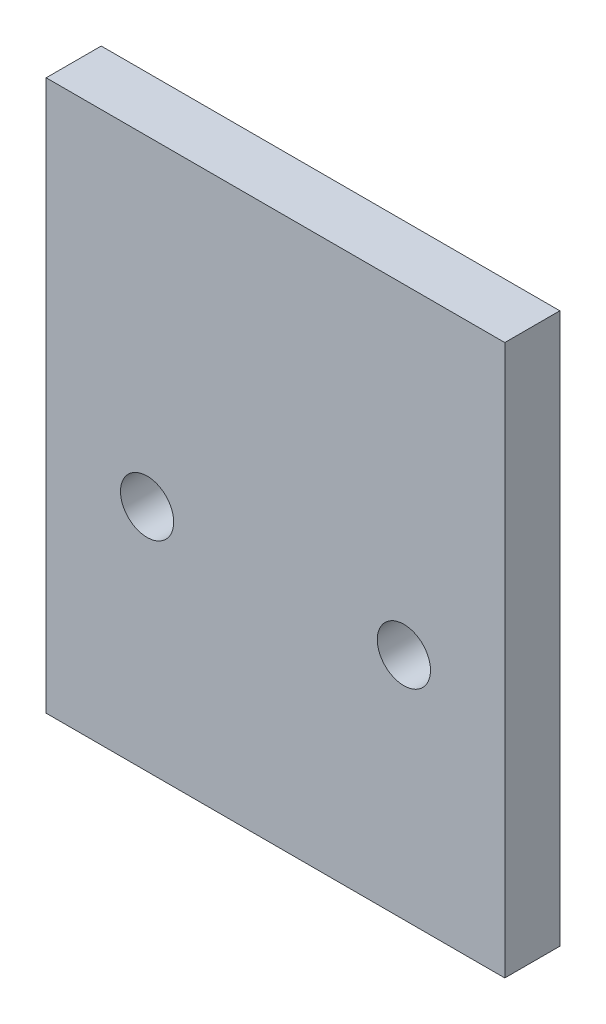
ISO-10303-21;
HEADER;
FILE_DESCRIPTION(('STEP AP214'),'2;1');
FILE_NAME('part.step','',(''),(''),'','','');
FILE_SCHEMA(('AUTOMOTIVE_DESIGN { 1 0 10303 214 1 1 1 1 }'));
ENDSEC;
DATA;
#1=APPLICATION_CONTEXT('core data for automotive mechanical design processes');
#2=APPLICATION_PROTOCOL_DEFINITION('international standard','automotive_design',2000,#1);
#3=PRODUCT_CONTEXT('',#1,'mechanical');
#4=PRODUCT('Part','Part','',(#3));
#5=PRODUCT_RELATED_PRODUCT_CATEGORY('part','',(#4));
#6=PRODUCT_DEFINITION_FORMATION('','',#4);
#7=PRODUCT_DEFINITION_CONTEXT('part definition',#1,'design');
#8=PRODUCT_DEFINITION('design','',#6,#7);
#9=PRODUCT_DEFINITION_SHAPE('','',#8);
#10=(LENGTH_UNIT() NAMED_UNIT(*) SI_UNIT(.MILLI.,.METRE.));
#11=(NAMED_UNIT(*) PLANE_ANGLE_UNIT() SI_UNIT($,.RADIAN.));
#12=(NAMED_UNIT(*) SI_UNIT($,.STERADIAN.) SOLID_ANGLE_UNIT());
#13=UNCERTAINTY_MEASURE_WITH_UNIT(LENGTH_MEASURE(1.E-05),#10,'distance_accuracy_value','');
#14=(GEOMETRIC_REPRESENTATION_CONTEXT(3) GLOBAL_UNCERTAINTY_ASSIGNED_CONTEXT((#13)) GLOBAL_UNIT_ASSIGNED_CONTEXT((#10,
#11,#12)) REPRESENTATION_CONTEXT('',''));
#15=CARTESIAN_POINT('',(0.,0.,0.));
#16=DIRECTION('',(0.,0.,1.));
#17=DIRECTION('',(1.,0.,0.));
#18=AXIS2_PLACEMENT_3D('',#15,#16,#17);
#19=CARTESIAN_POINT('',(0.,0.,3.));
#20=DIRECTION('',(0.,0.,-1.));
#21=DIRECTION('',(-1.,0.,0.));
#22=AXIS2_PLACEMENT_3D('',#19,#20,#21);
#23=PLANE('',#22);
#24=DIRECTION('',(0.,-1.,0.));
#25=VECTOR('',#24,1.);
#26=CARTESIAN_POINT('',(0.,0.,3.));
#27=LINE('',#26,#25);
#28=CARTESIAN_POINT('',(0.,30.,3.));
#29=VERTEX_POINT('',#28);
#30=CARTESIAN_POINT('',(0.,0.,3.));
#31=VERTEX_POINT('',#30);
#32=EDGE_CURVE('E87',#29,#31,#27,.T.);
#33=ORIENTED_EDGE('',*,*,#32,.T.);
#34=DIRECTION('',(1.,0.,0.));
#35=VECTOR('',#34,1.);
#36=CARTESIAN_POINT('',(0.,0.,3.));
#37=LINE('',#36,#35);
#38=CARTESIAN_POINT('',(25.,0.,3.));
#39=VERTEX_POINT('',#38);
#40=EDGE_CURVE('E82',#31,#39,#37,.T.);
#41=ORIENTED_EDGE('',*,*,#40,.T.);
#42=DIRECTION('',(0.,1.,0.));
#43=VECTOR('',#42,1.);
#44=CARTESIAN_POINT('',(25.,0.,3.));
#45=LINE('',#44,#43);
#46=CARTESIAN_POINT('',(25.,30.,3.));
#47=VERTEX_POINT('',#46);
#48=EDGE_CURVE('E85',#39,#47,#45,.T.);
#49=ORIENTED_EDGE('',*,*,#48,.T.);
#50=DIRECTION('',(-1.,0.,0.));
#51=VECTOR('',#50,1.);
#52=CARTESIAN_POINT('',(0.,30.,3.));
#53=LINE('',#52,#51);
#54=EDGE_CURVE('E52',#47,#29,#53,.T.);
#55=ORIENTED_EDGE('',*,*,#54,.T.);
#56=EDGE_LOOP('',(#33,#41,#49,#55));
#57=FACE_BOUND('',#56,.T.);
#58=CARTESIAN_POINT('',(19.5,12.5,3.));
#59=DIRECTION('',(0.,0.,1.));
#60=DIRECTION('',(1.,0.,0.));
#61=AXIS2_PLACEMENT_3D('',#58,#59,#60);
#62=CIRCLE('',#61,1.45);
#63=CARTESIAN_POINT('',(20.95,12.5,3.));
#64=VERTEX_POINT('',#63);
#65=EDGE_CURVE('E102',#64,#64,#62,.T.);
#66=ORIENTED_EDGE('',*,*,#65,.F.);
#67=EDGE_LOOP('',(#66));
#68=FACE_BOUND('',#67,.T.);
#69=CARTESIAN_POINT('',(5.5,12.5,3.));
#70=DIRECTION('',(0.,0.,1.));
#71=DIRECTION('',(-1.,0.,0.));
#72=AXIS2_PLACEMENT_3D('',#69,#70,#71);
#73=CIRCLE('',#72,1.45);
#74=CARTESIAN_POINT('',(4.05,12.5,3.));
#75=VERTEX_POINT('',#74);
#76=EDGE_CURVE('E117',#75,#75,#73,.T.);
#77=ORIENTED_EDGE('',*,*,#76,.F.);
#78=EDGE_LOOP('',(#77));
#79=FACE_BOUND('',#78,.T.);
#80=ADVANCED_FACE('F35',(#57,#68,#79),#23,.F.);
#81=CARTESIAN_POINT('',(0.,0.,0.));
#82=DIRECTION('',(0.,0.,-1.));
#83=DIRECTION('',(-1.,0.,0.));
#84=AXIS2_PLACEMENT_3D('',#81,#82,#83);
#85=PLANE('',#84);
#86=CARTESIAN_POINT('',(19.5,12.5,0.));
#87=DIRECTION('',(0.,0.,1.));
#88=DIRECTION('',(1.,0.,0.));
#89=AXIS2_PLACEMENT_3D('',#86,#87,#88);
#90=CIRCLE('',#89,1.45);
#91=CARTESIAN_POINT('',(20.95,12.5,0.));
#92=VERTEX_POINT('',#91);
#93=EDGE_CURVE('E114',#92,#92,#90,.T.);
#94=ORIENTED_EDGE('',*,*,#93,.T.);
#95=EDGE_LOOP('',(#94));
#96=FACE_BOUND('',#95,.T.);
#97=DIRECTION('',(0.,-1.,0.));
#98=VECTOR('',#97,1.);
#99=CARTESIAN_POINT('',(0.,0.,0.));
#100=LINE('',#99,#98);
#101=CARTESIAN_POINT('',(0.,30.,0.));
#102=VERTEX_POINT('',#101);
#103=CARTESIAN_POINT('',(0.,0.,0.));
#104=VERTEX_POINT('',#103);
#105=EDGE_CURVE('E99',#102,#104,#100,.T.);
#106=ORIENTED_EDGE('',*,*,#105,.F.);
#107=DIRECTION('',(-1.,0.,0.));
#108=VECTOR('',#107,1.);
#109=CARTESIAN_POINT('',(0.,30.,0.));
#110=LINE('',#109,#108);
#111=CARTESIAN_POINT('',(25.,30.,0.));
#112=VERTEX_POINT('',#111);
#113=EDGE_CURVE('E75',#112,#102,#110,.T.);
#114=ORIENTED_EDGE('',*,*,#113,.F.);
#115=DIRECTION('',(0.,1.,0.));
#116=VECTOR('',#115,1.);
#117=CARTESIAN_POINT('',(25.,0.,0.));
#118=LINE('',#117,#116);
#119=CARTESIAN_POINT('',(25.,0.,0.));
#120=VERTEX_POINT('',#119);
#121=EDGE_CURVE('E69',#120,#112,#118,.T.);
#122=ORIENTED_EDGE('',*,*,#121,.F.);
#123=DIRECTION('',(1.,0.,0.));
#124=VECTOR('',#123,1.);
#125=CARTESIAN_POINT('',(0.,0.,0.));
#126=LINE('',#125,#124);
#127=EDGE_CURVE('E91',#104,#120,#126,.T.);
#128=ORIENTED_EDGE('',*,*,#127,.F.);
#129=EDGE_LOOP('',(#106,#114,#122,#128));
#130=FACE_BOUND('',#129,.T.);
#131=CARTESIAN_POINT('',(5.5,12.5,0.));
#132=DIRECTION('',(0.,0.,1.));
#133=DIRECTION('',(-1.,0.,0.));
#134=AXIS2_PLACEMENT_3D('',#131,#132,#133);
#135=CIRCLE('',#134,1.45);
#136=CARTESIAN_POINT('',(4.05,12.5,0.));
#137=VERTEX_POINT('',#136);
#138=EDGE_CURVE('E120',#137,#137,#135,.T.);
#139=ORIENTED_EDGE('',*,*,#138,.T.);
#140=EDGE_LOOP('',(#139));
#141=FACE_BOUND('',#140,.T.);
#142=ADVANCED_FACE('F110',(#96,#130,#141),#85,.T.);
#143=CARTESIAN_POINT('',(0.,0.,3.));
#144=DIRECTION('',(1.,0.,0.));
#145=DIRECTION('',(0.,0.,-1.));
#146=AXIS2_PLACEMENT_3D('',#143,#144,#145);
#147=PLANE('',#146);
#148=ORIENTED_EDGE('',*,*,#105,.T.);
#149=DIRECTION('',(0.,0.,-1.));
#150=VECTOR('',#149,1.);
#151=CARTESIAN_POINT('',(0.,0.,3.));
#152=LINE('',#151,#150);
#153=EDGE_CURVE('E11',#31,#104,#152,.T.);
#154=ORIENTED_EDGE('',*,*,#153,.F.);
#155=ORIENTED_EDGE('',*,*,#32,.F.);
#156=DIRECTION('',(0.,0.,-1.));
#157=VECTOR('',#156,1.);
#158=CARTESIAN_POINT('',(0.,30.,3.));
#159=LINE('',#158,#157);
#160=EDGE_CURVE('E95',#29,#102,#159,.T.);
#161=ORIENTED_EDGE('',*,*,#160,.T.);
#162=EDGE_LOOP('',(#148,#154,#155,#161));
#163=FACE_BOUND('',#162,.T.);
#164=ADVANCED_FACE('F37',(#163),#147,.F.);
#165=CARTESIAN_POINT('',(0.,0.,3.));
#166=DIRECTION('',(0.,1.,0.));
#167=DIRECTION('',(0.,0.,1.));
#168=AXIS2_PLACEMENT_3D('',#165,#166,#167);
#169=PLANE('',#168);
#170=ORIENTED_EDGE('',*,*,#127,.T.);
#171=DIRECTION('',(0.,0.,-1.));
#172=VECTOR('',#171,1.);
#173=CARTESIAN_POINT('',(25.,0.,3.));
#174=LINE('',#173,#172);
#175=EDGE_CURVE('E44',#39,#120,#174,.T.);
#176=ORIENTED_EDGE('',*,*,#175,.F.);
#177=ORIENTED_EDGE('',*,*,#40,.F.);
#178=ORIENTED_EDGE('',*,*,#153,.T.);
#179=EDGE_LOOP('',(#170,#176,#177,#178));
#180=FACE_BOUND('',#179,.T.);
#181=ADVANCED_FACE('F90',(#180),#169,.F.);
#182=CARTESIAN_POINT('',(25.,0.,3.));
#183=DIRECTION('',(-1.,0.,0.));
#184=DIRECTION('',(0.,0.,1.));
#185=AXIS2_PLACEMENT_3D('',#182,#183,#184);
#186=PLANE('',#185);
#187=ORIENTED_EDGE('',*,*,#121,.T.);
#188=DIRECTION('',(0.,0.,-1.));
#189=VECTOR('',#188,1.);
#190=CARTESIAN_POINT('',(25.,30.,3.));
#191=LINE('',#190,#189);
#192=EDGE_CURVE('E92',#47,#112,#191,.T.);
#193=ORIENTED_EDGE('',*,*,#192,.F.);
#194=ORIENTED_EDGE('',*,*,#48,.F.);
#195=ORIENTED_EDGE('',*,*,#175,.T.);
#196=EDGE_LOOP('',(#187,#193,#194,#195));
#197=FACE_BOUND('',#196,.T.);
#198=ADVANCED_FACE('F93',(#197),#186,.F.);
#199=CARTESIAN_POINT('',(0.,30.,3.));
#200=DIRECTION('',(0.,-1.,0.));
#201=DIRECTION('',(1.,0.,0.));
#202=AXIS2_PLACEMENT_3D('',#199,#200,#201);
#203=PLANE('',#202);
#204=ORIENTED_EDGE('',*,*,#113,.T.);
#205=ORIENTED_EDGE('',*,*,#160,.F.);
#206=ORIENTED_EDGE('',*,*,#54,.F.);
#207=ORIENTED_EDGE('',*,*,#192,.T.);
#208=EDGE_LOOP('',(#204,#205,#206,#207));
#209=FACE_BOUND('',#208,.T.);
#210=ADVANCED_FACE('F107',(#209),#203,.F.);
#211=CARTESIAN_POINT('',(19.5,12.5,3.));
#212=DIRECTION('',(0.,0.,-1.));
#213=DIRECTION('',(-1.,0.,0.));
#214=AXIS2_PLACEMENT_3D('',#211,#212,#213);
#215=CYLINDRICAL_SURFACE('',#214,1.45);
#216=ORIENTED_EDGE('',*,*,#65,.T.);
#217=EDGE_LOOP('',(#216));
#218=FACE_BOUND('',#217,.T.);
#219=ORIENTED_EDGE('',*,*,#93,.F.);
#220=EDGE_LOOP('',(#219));
#221=FACE_BOUND('',#220,.T.);
#222=ADVANCED_FACE('F137',(#218,#221),#215,.F.);
#223=CARTESIAN_POINT('',(5.5,12.5,3.));
#224=DIRECTION('',(0.,0.,-1.));
#225=DIRECTION('',(-1.,0.,0.));
#226=AXIS2_PLACEMENT_3D('',#223,#224,#225);
#227=CYLINDRICAL_SURFACE('',#226,1.45);
#228=ORIENTED_EDGE('',*,*,#76,.T.);
#229=EDGE_LOOP('',(#228));
#230=FACE_BOUND('',#229,.T.);
#231=ORIENTED_EDGE('',*,*,#138,.F.);
#232=EDGE_LOOP('',(#231));
#233=FACE_BOUND('',#232,.T.);
#234=ADVANCED_FACE('F126',(#230,#233),#227,.F.);
#235=CLOSED_SHELL('',(#80,#142,#164,#181,#198,#210,#222,#234));
#236=MANIFOLD_SOLID_BREP('B2',#235);
#237=ADVANCED_BREP_SHAPE_REPRESENTATION('',(#18,#236),#14);
#238=SHAPE_DEFINITION_REPRESENTATION(#9,#237);
ENDSEC;
END-ISO-10303-21;
